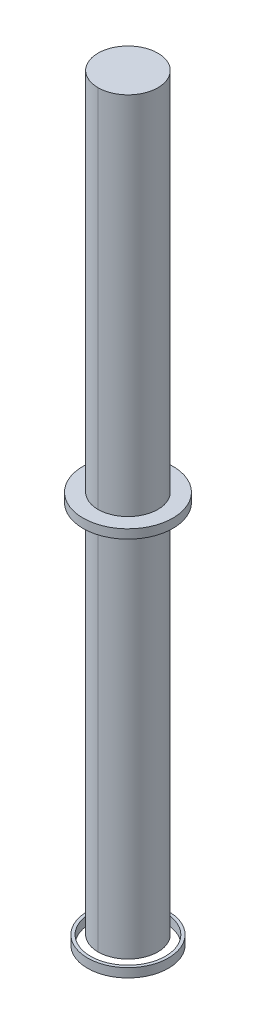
from build123d import *

# Parameters (mm, degrees)
SKETCH1_R           = 2
BOSS_EXTRUDE1_DEPTH = 50
SKETCH5_R           = 2.7
SKETCH5_R_2         = 2.5
BOSS_EXTRUDE4_DEPTH = 0.6
SKETCH6_R           = 3
SKETCH6_R_2         = 2
BOSS_EXTRUDE5_DEPTH = 0.6


with BuildPart() as part:
    # Sketch1 → Boss-Extrude1 (new body)
    with BuildSketch(Plane(origin=(0, 0, 0), x_dir=(1, 0, 0), z_dir=(0, 1, 0))):
        with Locations(Location((0, 0, 0), (0, 0, 270))):
            Circle(SKETCH1_R)
    extrude(amount=BOSS_EXTRUDE1_DEPTH)

    # Sketch6 → Boss-Extrude5 (add)
    with BuildSketch(Plane(origin=(0, 25, 0), x_dir=(1, 0, 0), z_dir=(0, 1, 0))):
        with Locations(Location((0, 0, 0), (0, 0, 270))):
            Circle(SKETCH6_R)
        with Locations(Location((0, 0, 0), (0, 0, 270))):
            Circle(SKETCH6_R_2, mode=Mode.SUBTRACT)
    extrude(amount=BOSS_EXTRUDE5_DEPTH)


with BuildPart() as body_2:
    # Sketch5 → Boss-Extrude4 (new body)
    with BuildSketch(Plane(origin=(0, 0, 0), x_dir=(1, 0, 0), z_dir=(0, 1, 0))):
        with Locations(Location((0, 0, 0), (0, 0, 270))):
            Circle(SKETCH5_R)
        with Locations(Location((0, 0, 0), (0, 0, 270))):
            Circle(SKETCH5_R_2, mode=Mode.SUBTRACT)
    extrude(amount=-BOSS_EXTRUDE4_DEPTH)


solid = Compound([part.part, body_2.part])
